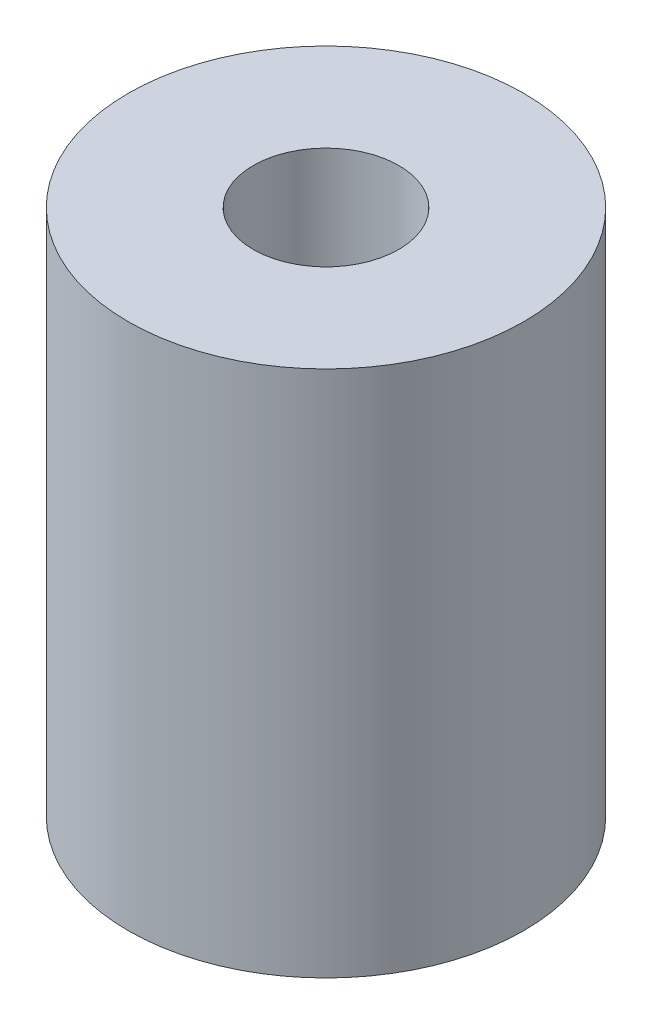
ISO-10303-21;
HEADER;
FILE_DESCRIPTION(('STEP AP214'),'2;1');
FILE_NAME('part.step','',(''),(''),'','','');
FILE_SCHEMA(('AUTOMOTIVE_DESIGN { 1 0 10303 214 1 1 1 1 }'));
ENDSEC;
DATA;
#1=APPLICATION_CONTEXT('core data for automotive mechanical design processes');
#2=APPLICATION_PROTOCOL_DEFINITION('international standard','automotive_design',2000,#1);
#3=PRODUCT_CONTEXT('',#1,'mechanical');
#4=PRODUCT('Part','Part','',(#3));
#5=PRODUCT_RELATED_PRODUCT_CATEGORY('part','',(#4));
#6=PRODUCT_DEFINITION_FORMATION('','',#4);
#7=PRODUCT_DEFINITION_CONTEXT('part definition',#1,'design');
#8=PRODUCT_DEFINITION('design','',#6,#7);
#9=PRODUCT_DEFINITION_SHAPE('','',#8);
#10=(LENGTH_UNIT() NAMED_UNIT(*) SI_UNIT(.MILLI.,.METRE.));
#11=(NAMED_UNIT(*) PLANE_ANGLE_UNIT() SI_UNIT($,.RADIAN.));
#12=(NAMED_UNIT(*) SI_UNIT($,.STERADIAN.) SOLID_ANGLE_UNIT());
#13=UNCERTAINTY_MEASURE_WITH_UNIT(LENGTH_MEASURE(1.E-05),#10,'distance_accuracy_value','');
#14=(GEOMETRIC_REPRESENTATION_CONTEXT(3) GLOBAL_UNCERTAINTY_ASSIGNED_CONTEXT((#13)) GLOBAL_UNIT_ASSIGNED_CONTEXT((#10,
#11,#12)) REPRESENTATION_CONTEXT('',''));
#15=CARTESIAN_POINT('',(0.,0.,0.));
#16=DIRECTION('',(0.,0.,1.));
#17=DIRECTION('',(1.,0.,0.));
#18=AXIS2_PLACEMENT_3D('',#15,#16,#17);
#19=CARTESIAN_POINT('',(0.,12.7,0.));
#20=DIRECTION('',(0.,-1.,0.));
#21=DIRECTION('',(0.,0.,-1.));
#22=AXIS2_PLACEMENT_3D('',#19,#20,#21);
#23=CYLINDRICAL_SURFACE('',#22,4.7625);
#24=CARTESIAN_POINT('',(0.,12.7,0.));
#25=DIRECTION('',(0.,1.,0.));
#26=DIRECTION('',(0.,0.,1.));
#27=AXIS2_PLACEMENT_3D('',#24,#25,#26);
#28=CIRCLE('',#27,4.7625);
#29=CARTESIAN_POINT('',(0.,12.7,4.7625));
#30=VERTEX_POINT('',#29);
#31=EDGE_CURVE('E12',#30,#30,#28,.T.);
#32=ORIENTED_EDGE('',*,*,#31,.F.);
#33=EDGE_LOOP('',(#32));
#34=FACE_BOUND('',#33,.T.);
#35=CARTESIAN_POINT('',(0.,0.,0.));
#36=DIRECTION('',(0.,1.,0.));
#37=DIRECTION('',(0.,0.,1.));
#38=AXIS2_PLACEMENT_3D('',#35,#36,#37);
#39=CIRCLE('',#38,4.7625);
#40=CARTESIAN_POINT('',(0.,0.,4.7625));
#41=VERTEX_POINT('',#40);
#42=EDGE_CURVE('E43',#41,#41,#39,.T.);
#43=ORIENTED_EDGE('',*,*,#42,.T.);
#44=EDGE_LOOP('',(#43));
#45=FACE_BOUND('',#44,.T.);
#46=ADVANCED_FACE('F40',(#34,#45),#23,.T.);
#47=CARTESIAN_POINT('',(0.,12.7,0.));
#48=DIRECTION('',(0.,1.,0.));
#49=DIRECTION('',(0.,0.,1.));
#50=AXIS2_PLACEMENT_3D('',#47,#48,#49);
#51=PLANE('',#50);
#52=CARTESIAN_POINT('',(0.,12.7,0.));
#53=DIRECTION('',(0.,1.,0.));
#54=DIRECTION('',(0.,0.,1.));
#55=AXIS2_PLACEMENT_3D('',#52,#53,#54);
#56=CIRCLE('',#55,1.75259999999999);
#57=CARTESIAN_POINT('',(0.,12.7,1.75259999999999));
#58=VERTEX_POINT('',#57);
#59=EDGE_CURVE('E50',#58,#58,#56,.T.);
#60=ORIENTED_EDGE('',*,*,#59,.F.);
#61=EDGE_LOOP('',(#60));
#62=FACE_BOUND('',#61,.T.);
#63=ORIENTED_EDGE('',*,*,#31,.T.);
#64=EDGE_LOOP('',(#63));
#65=FACE_BOUND('',#64,.T.);
#66=ADVANCED_FACE('F67',(#62,#65),#51,.T.);
#67=CARTESIAN_POINT('',(0.,0.,0.));
#68=DIRECTION('',(0.,1.,0.));
#69=DIRECTION('',(0.,0.,1.));
#70=AXIS2_PLACEMENT_3D('',#67,#68,#69);
#71=PLANE('',#70);
#72=CARTESIAN_POINT('',(0.,0.,0.));
#73=DIRECTION('',(0.,1.,0.));
#74=DIRECTION('',(0.,0.,1.));
#75=AXIS2_PLACEMENT_3D('',#72,#73,#74);
#76=CIRCLE('',#75,1.7526);
#77=CARTESIAN_POINT('',(0.,0.,1.7526));
#78=VERTEX_POINT('',#77);
#79=EDGE_CURVE('E54',#78,#78,#76,.T.);
#80=ORIENTED_EDGE('',*,*,#79,.T.);
#81=EDGE_LOOP('',(#80));
#82=FACE_BOUND('',#81,.T.);
#83=ORIENTED_EDGE('',*,*,#42,.F.);
#84=EDGE_LOOP('',(#83));
#85=FACE_BOUND('',#84,.T.);
#86=ADVANCED_FACE('F58',(#82,#85),#71,.F.);
#87=CARTESIAN_POINT('',(0.,12.7,0.));
#88=DIRECTION('',(0.,1.,0.));
#89=DIRECTION('',(0.,0.,1.));
#90=AXIS2_PLACEMENT_3D('',#87,#88,#89);
#91=CYLINDRICAL_SURFACE('',#90,1.75259999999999);
#92=ORIENTED_EDGE('',*,*,#79,.F.);
#93=EDGE_LOOP('',(#92));
#94=FACE_BOUND('',#93,.T.);
#95=ORIENTED_EDGE('',*,*,#59,.T.);
#96=EDGE_LOOP('',(#95));
#97=FACE_BOUND('',#96,.T.);
#98=ADVANCED_FACE('F61',(#94,#97),#91,.F.);
#99=CLOSED_SHELL('',(#46,#66,#86,#98));
#100=MANIFOLD_SOLID_BREP('B2',#99);
#101=ADVANCED_BREP_SHAPE_REPRESENTATION('',(#18,#100),#14);
#102=SHAPE_DEFINITION_REPRESENTATION(#9,#101);
ENDSEC;
END-ISO-10303-21;
